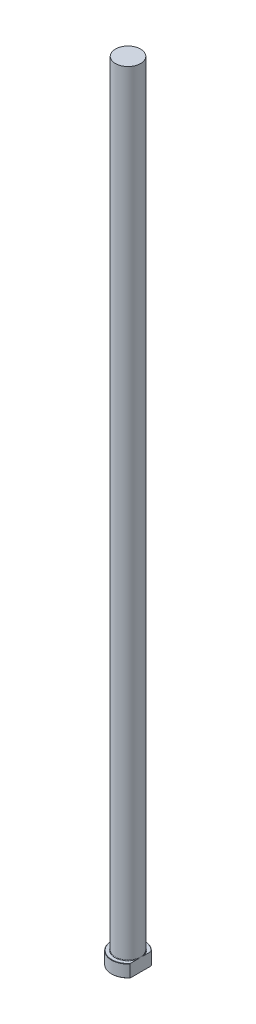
ISO-10303-21;
HEADER;
FILE_DESCRIPTION(('STEP AP214'),'2;1');
FILE_NAME('part.step','',(''),(''),'','','');
FILE_SCHEMA(('AUTOMOTIVE_DESIGN { 1 0 10303 214 1 1 1 1 }'));
ENDSEC;
DATA;
#1=APPLICATION_CONTEXT('core data for automotive mechanical design processes');
#2=APPLICATION_PROTOCOL_DEFINITION('international standard','automotive_design',2000,#1);
#3=PRODUCT_CONTEXT('',#1,'mechanical');
#4=PRODUCT('Part','Part','',(#3));
#5=PRODUCT_RELATED_PRODUCT_CATEGORY('part','',(#4));
#6=PRODUCT_DEFINITION_FORMATION('','',#4);
#7=PRODUCT_DEFINITION_CONTEXT('part definition',#1,'design');
#8=PRODUCT_DEFINITION('design','',#6,#7);
#9=PRODUCT_DEFINITION_SHAPE('','',#8);
#10=(LENGTH_UNIT() NAMED_UNIT(*) SI_UNIT(.MILLI.,.METRE.));
#11=(NAMED_UNIT(*) PLANE_ANGLE_UNIT() SI_UNIT($,.RADIAN.));
#12=(NAMED_UNIT(*) SI_UNIT($,.STERADIAN.) SOLID_ANGLE_UNIT());
#13=UNCERTAINTY_MEASURE_WITH_UNIT(LENGTH_MEASURE(1.E-05),#10,'distance_accuracy_value','');
#14=(GEOMETRIC_REPRESENTATION_CONTEXT(3) GLOBAL_UNCERTAINTY_ASSIGNED_CONTEXT((#13)) GLOBAL_UNIT_ASSIGNED_CONTEXT((#10,
#11,#12)) REPRESENTATION_CONTEXT('',''));
#15=CARTESIAN_POINT('',(0.,0.,0.));
#16=DIRECTION('',(0.,0.,1.));
#17=DIRECTION('',(1.,0.,0.));
#18=AXIS2_PLACEMENT_3D('',#15,#16,#17);
#19=CARTESIAN_POINT('',(0.,0.,0.));
#20=DIRECTION('',(0.,-1.,0.));
#21=DIRECTION('',(0.,0.,-1.));
#22=AXIS2_PLACEMENT_3D('',#19,#20,#21);
#23=PLANE('',#22);
#24=CARTESIAN_POINT('',(0.,0.,0.));
#25=DIRECTION('',(0.,-1.,0.));
#26=DIRECTION('',(0.,0.,-1.));
#27=AXIS2_PLACEMENT_3D('',#24,#25,#26);
#28=CIRCLE('',#27,10.3);
#29=CARTESIAN_POINT('',(7.99999999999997,0.,6.48768063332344));
#30=VERTEX_POINT('',#29);
#31=CARTESIAN_POINT('',(7.99999999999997,0.,-6.48768063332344));
#32=VERTEX_POINT('',#31);
#33=EDGE_CURVE('E98',#30,#32,#28,.T.);
#34=ORIENTED_EDGE('',*,*,#33,.T.);
#35=DIRECTION('',(0.,0.,1.));
#36=VECTOR('',#35,1.);
#37=CARTESIAN_POINT('',(7.99999999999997,0.,6.80073525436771));
#38=LINE('',#37,#36);
#39=EDGE_CURVE('E83',#32,#30,#38,.T.);
#40=ORIENTED_EDGE('',*,*,#39,.T.);
#41=EDGE_LOOP('',(#34,#40));
#42=FACE_BOUND('',#41,.T.);
#43=ADVANCED_FACE('F32',(#42),#23,.T.);
#44=CARTESIAN_POINT('',(0.,259.958771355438,0.));
#45=DIRECTION('',(0.,1.,0.));
#46=DIRECTION('',(0.,0.,1.));
#47=AXIS2_PLACEMENT_3D('',#44,#45,#46);
#48=CYLINDRICAL_SURFACE('',#47,10.5);
#49=CARTESIAN_POINT('',(0.,7.79999999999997,0.));
#50=DIRECTION('',(0.,1.,0.));
#51=DIRECTION('',(0.,0.,1.));
#52=AXIS2_PLACEMENT_3D('',#49,#50,#51);
#53=CIRCLE('',#52,10.5);
#54=CARTESIAN_POINT('',(7.99999999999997,7.79999999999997,6.80073525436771));
#55=VERTEX_POINT('',#54);
#56=CARTESIAN_POINT('',(7.99999999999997,7.79999999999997,-6.80073525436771));
#57=VERTEX_POINT('',#56);
#58=EDGE_CURVE('E104',#55,#57,#53,.F.);
#59=ORIENTED_EDGE('',*,*,#58,.T.);
#60=DIRECTION('',(0.,-1.,0.));
#61=VECTOR('',#60,1.);
#62=CARTESIAN_POINT('',(7.99999999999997,500.,-6.80073525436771));
#63=LINE('',#62,#61);
#64=CARTESIAN_POINT('',(7.99999999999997,0.199999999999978,-6.80073525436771));
#65=VERTEX_POINT('',#64);
#66=EDGE_CURVE('E183',#57,#65,#63,.T.);
#67=ORIENTED_EDGE('',*,*,#66,.T.);
#68=CARTESIAN_POINT('',(0.,0.199999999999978,0.));
#69=DIRECTION('',(0.,-1.,0.));
#70=DIRECTION('',(0.,0.,-1.));
#71=AXIS2_PLACEMENT_3D('',#68,#69,#70);
#72=CIRCLE('',#71,10.5);
#73=CARTESIAN_POINT('',(7.99999999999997,0.199999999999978,6.80073525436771));
#74=VERTEX_POINT('',#73);
#75=EDGE_CURVE('E100',#65,#74,#72,.F.);
#76=ORIENTED_EDGE('',*,*,#75,.T.);
#77=DIRECTION('',(0.,-1.,0.));
#78=VECTOR('',#77,1.);
#79=CARTESIAN_POINT('',(7.99999999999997,500.,6.80073525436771));
#80=LINE('',#79,#78);
#81=EDGE_CURVE('E93',#55,#74,#80,.T.);
#82=ORIENTED_EDGE('',*,*,#81,.F.);
#83=EDGE_LOOP('',(#59,#67,#76,#82));
#84=FACE_BOUND('',#83,.T.);
#85=ADVANCED_FACE('F158',(#84),#48,.T.);
#86=CARTESIAN_POINT('',(-10.5,8.,0.));
#87=DIRECTION('',(0.,1.,0.));
#88=DIRECTION('',(0.,0.,1.));
#89=AXIS2_PLACEMENT_3D('',#86,#87,#88);
#90=PLANE('',#89);
#91=CARTESIAN_POINT('',(0.,8.,0.));
#92=DIRECTION('',(0.,1.,0.));
#93=DIRECTION('',(0.,0.,1.));
#94=AXIS2_PLACEMENT_3D('',#91,#92,#93);
#95=CIRCLE('',#94,10.2999999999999);
#96=CARTESIAN_POINT('',(7.99999999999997,8.,-6.48768063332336));
#97=VERTEX_POINT('',#96);
#98=CARTESIAN_POINT('',(7.99999999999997,8.,6.48768063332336));
#99=VERTEX_POINT('',#98);
#100=EDGE_CURVE('E178',#97,#99,#95,.T.);
#101=ORIENTED_EDGE('',*,*,#100,.T.);
#102=DIRECTION('',(0.,0.,-1.));
#103=VECTOR('',#102,1.);
#104=CARTESIAN_POINT('',(7.99999999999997,8.,0.));
#105=LINE('',#104,#103);
#106=CARTESIAN_POINT('',(7.99999999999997,7.99999999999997,2.21133443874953));
#107=VERTEX_POINT('',#106);
#108=EDGE_CURVE('E57',#99,#107,#105,.T.);
#109=ORIENTED_EDGE('',*,*,#108,.T.);
#110=CARTESIAN_POINT('',(0.,8.,0.));
#111=DIRECTION('',(0.,1.,0.));
#112=DIRECTION('',(0.,0.,1.));
#113=AXIS2_PLACEMENT_3D('',#110,#111,#112);
#114=CIRCLE('',#113,8.29999999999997);
#115=CARTESIAN_POINT('',(7.99999999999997,7.99999999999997,-2.21133443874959));
#116=VERTEX_POINT('',#115);
#117=EDGE_CURVE('E107',#107,#116,#114,.F.);
#118=ORIENTED_EDGE('',*,*,#117,.T.);
#119=EDGE_CURVE('E136',#116,#97,#105,.T.);
#120=ORIENTED_EDGE('',*,*,#119,.T.);
#121=EDGE_LOOP('',(#101,#109,#118,#120));
#122=FACE_BOUND('',#121,.T.);
#123=ADVANCED_FACE('F147',(#122),#90,.T.);
#124=CARTESIAN_POINT('',(0.,8.00000000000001,0.));
#125=DIRECTION('',(0.,-1.,0.));
#126=DIRECTION('',(0.,0.,-1.));
#127=AXIS2_PLACEMENT_3D('',#124,#125,#126);
#128=CONICAL_SURFACE('',#127,10.2999999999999,0.785398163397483);
#129=ORIENTED_EDGE('',*,*,#58,.F.);
#130=CARTESIAN_POINT('',(7.99999999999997,1.33290288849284,14.962699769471));
#131=CARTESIAN_POINT('',(7.99999999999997,1.526020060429,14.743707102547));
#132=CARTESIAN_POINT('',(7.99999999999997,1.71861310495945,14.5242518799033));
#133=CARTESIAN_POINT('',(7.99999999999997,2.10260185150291,14.084291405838));
#134=CARTESIAN_POINT('',(7.99999999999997,2.29399753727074,13.8637861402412));
#135=CARTESIAN_POINT('',(7.99999999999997,2.86631093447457,13.2003384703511));
#136=CARTESIAN_POINT('',(7.99999999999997,3.24519896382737,12.7556406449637));
#137=CARTESIAN_POINT('',(7.99999999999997,4.0021705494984,11.8528322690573));
#138=CARTESIAN_POINT('',(7.99999999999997,4.38013535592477,11.3946217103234));
#139=CARTESIAN_POINT('',(7.99999999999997,4.93959938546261,10.7013455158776));
#140=CARTESIAN_POINT('',(7.99999999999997,5.12482184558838,10.4692838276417));
#141=CARTESIAN_POINT('',(7.99999999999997,5.49233220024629,10.0028504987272));
#142=CARTESIAN_POINT('',(7.99999999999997,5.67462014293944,9.76847889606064));
#143=CARTESIAN_POINT('',(7.99999999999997,6.03122068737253,9.30294410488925));
#144=CARTESIAN_POINT('',(7.99999999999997,6.20561882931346,9.071846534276));
#145=CARTESIAN_POINT('',(7.99999999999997,6.5504696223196,8.6067314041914));
#146=CARTESIAN_POINT('',(7.99999999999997,6.72092239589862,8.37271393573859));
#147=CARTESIAN_POINT('',(7.99999999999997,7.05721475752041,7.90111240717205));
#148=CARTESIAN_POINT('',(7.99999999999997,7.22305076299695,7.66352578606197));
#149=CARTESIAN_POINT('',(7.99999999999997,7.54895071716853,7.18442085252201));
#150=CARTESIAN_POINT('',(7.99999999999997,7.70901478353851,6.9429026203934));
#151=CARTESIAN_POINT('',(7.99999999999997,8.02131569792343,6.4564670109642));
#152=CARTESIAN_POINT('',(7.99999999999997,8.17358627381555,6.21157137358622));
#153=CARTESIAN_POINT('',(7.99999999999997,8.46946507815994,5.71653825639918));
#154=CARTESIAN_POINT('',(7.99999999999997,8.61307235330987,5.46640020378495));
#155=CARTESIAN_POINT('',(7.99999999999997,8.88928106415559,4.96049315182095));
#156=CARTESIAN_POINT('',(7.99999999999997,9.02189622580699,4.7047316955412));
#157=CARTESIAN_POINT('',(7.99999999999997,9.27354681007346,4.18665771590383));
#158=CARTESIAN_POINT('',(7.99999999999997,9.39258682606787,3.92434744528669));
#159=CARTESIAN_POINT('',(7.99999999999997,9.60651271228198,3.40995211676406));
#160=CARTESIAN_POINT('',(7.99999999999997,9.70246745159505,3.15831564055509));
#161=CARTESIAN_POINT('',(7.99999999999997,9.87629299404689,2.64880033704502));
#162=CARTESIAN_POINT('',(7.99999999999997,9.95416436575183,2.39092170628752));
#163=CARTESIAN_POINT('',(7.99999999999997,10.0879563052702,1.87092888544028));
#164=CARTESIAN_POINT('',(7.99999999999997,10.1439929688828,1.60884503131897));
#165=CARTESIAN_POINT('',(7.99999999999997,10.2315501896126,1.08057866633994));
#166=CARTESIAN_POINT('',(7.99999999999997,10.2630742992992,0.814396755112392));
#167=CARTESIAN_POINT('',(7.99999999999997,10.2997165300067,0.277429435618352));
#168=CARTESIAN_POINT('',(7.99999999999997,10.3045597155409,0.0066248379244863));
#169=CARTESIAN_POINT('',(7.99999999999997,10.2867490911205,-0.53406557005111));
#170=CARTESIAN_POINT('',(7.99999999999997,10.2640944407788,-0.803951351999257));
#171=CARTESIAN_POINT('',(7.99999999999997,10.1927263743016,-1.34133090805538));
#172=CARTESIAN_POINT('',(7.99999999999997,10.1439052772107,-1.60881012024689));
#173=CARTESIAN_POINT('',(7.99999999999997,10.0231407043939,-2.1384525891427));
#174=CARTESIAN_POINT('',(7.99999999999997,9.95119208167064,-2.40061464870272));
#175=CARTESIAN_POINT('',(7.99999999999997,9.74748024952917,-3.04636811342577));
#176=CARTESIAN_POINT('',(7.99999999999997,9.60371170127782,-3.42615269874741));
#177=CARTESIAN_POINT('',(7.99999999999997,9.28388635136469,-4.17181961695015));
#178=CARTESIAN_POINT('',(7.99999999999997,9.1078037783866,-4.53769057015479));
#179=CARTESIAN_POINT('',(7.99999999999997,8.73074535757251,-5.25986235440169));
#180=CARTESIAN_POINT('',(7.99999999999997,8.5295854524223,-5.61606586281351));
#181=CARTESIAN_POINT('',(7.99999999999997,8.10999259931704,-6.31785404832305));
#182=CARTESIAN_POINT('',(7.99999999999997,7.89156598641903,-6.66344255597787));
#183=CARTESIAN_POINT('',(7.99999999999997,7.42856923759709,-7.36627135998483));
#184=CARTESIAN_POINT('',(7.99999999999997,7.18321693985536,-7.72299299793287));
#185=CARTESIAN_POINT('',(7.99999999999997,6.68175990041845,-8.42882665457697));
#186=CARTESIAN_POINT('',(7.99999999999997,6.42565362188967,-8.77793757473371));
#187=CARTESIAN_POINT('',(7.99999999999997,5.90506129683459,-9.47030065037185));
#188=CARTESIAN_POINT('',(7.99999999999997,5.64056823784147,-9.81354751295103));
#189=CARTESIAN_POINT('',(7.99999999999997,5.10523485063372,-10.4950589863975));
#190=CARTESIAN_POINT('',(7.99999999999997,4.83439431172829,-10.8333234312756));
#191=CARTESIAN_POINT('',(7.99999999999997,4.29890379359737,-11.4919935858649));
#192=CARTESIAN_POINT('',(7.99999999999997,4.03445487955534,-11.8125631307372));
#193=CARTESIAN_POINT('',(7.99999999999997,3.5018148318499,-12.4505862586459));
#194=CARTESIAN_POINT('',(7.99999999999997,3.23362361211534,-12.7680397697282));
#195=CARTESIAN_POINT('',(7.99999999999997,2.69477946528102,-13.3996284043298));
#196=CARTESIAN_POINT('',(7.99999999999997,2.42413333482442,-13.7137693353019));
#197=CARTESIAN_POINT('',(7.99999999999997,1.88030288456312,-14.3398122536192));
#198=CARTESIAN_POINT('',(7.99999999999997,1.60711872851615,-14.6517143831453));
#199=CARTESIAN_POINT('',(7.99999999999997,1.33290288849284,-14.962699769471));
#200=B_SPLINE_CURVE_WITH_KNOTS('',3,(#130,#131,#132,#133,#134,#135,#136,#137,#138,#139,#140,
#141,#142,#143,#144,#145,#146,#147,#148,#149,#150,#151,#152,#153,#154,#155,#156,#157,#158,#159,
#160,#161,#162,#163,#164,#165,#166,#167,#168,#169,#170,#171,#172,#173,#174,#175,#176,#177,#178,
#179,#180,#181,#182,#183,#184,#185,#186,#187,#188,#189,#190,#191,#192,#193,#194,#195,#196,#197,
#198,#199),.UNSPECIFIED.,.F.,.F.,(4,2,2,2,2,2,2,2,2,2,2,2,2,2,2,2,2,2,2,2,2,2,2,2,2,2,2,2,2,2,2,
2,2,2,4),(0.,0.875937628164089,1.75188711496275,3.50449265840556,5.28632072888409,
6.17705462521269,7.06777388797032,7.93629376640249,8.8047866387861,9.67393565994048,
10.5430669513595,11.4080477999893,12.2731236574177,13.1371024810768,14.0007880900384,
14.8081551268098,15.6154967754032,16.4184851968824,17.221357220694,18.032487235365,
18.8436420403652,19.6581608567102,20.4728610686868,21.688930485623,22.9059739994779,
24.1325435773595,25.3586652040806,26.6572591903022,27.9560393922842,29.2559357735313,
30.5558753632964,31.8025502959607,33.0492539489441,34.2931865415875,35.5370394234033),.UNSPECIFIED.);
#201=EDGE_CURVE('E135',#55,#99,#200,.T.);
#202=ORIENTED_EDGE('',*,*,#201,.T.);
#203=ORIENTED_EDGE('',*,*,#100,.F.);
#204=EDGE_CURVE('E127',#97,#57,#200,.T.);
#205=ORIENTED_EDGE('',*,*,#204,.T.);
#206=EDGE_LOOP('',(#129,#202,#203,#205));
#207=FACE_BOUND('',#206,.T.);
#208=ADVANCED_FACE('F143',(#207),#128,.T.);
#209=CARTESIAN_POINT('',(0.,0.199999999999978,0.));
#210=DIRECTION('',(0.,1.,0.));
#211=DIRECTION('',(0.,0.,1.));
#212=AXIS2_PLACEMENT_3D('',#209,#210,#211);
#213=CONICAL_SURFACE('',#212,10.5,0.785398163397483);
#214=ORIENTED_EDGE('',*,*,#75,.F.);
#215=CARTESIAN_POINT('',(7.99999999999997,6.66709711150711,-14.962699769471));
#216=CARTESIAN_POINT('',(7.99999999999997,6.47397993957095,-14.743707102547));
#217=CARTESIAN_POINT('',(7.99999999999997,6.2813868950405,-14.5242518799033));
#218=CARTESIAN_POINT('',(7.99999999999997,5.89739814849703,-14.084291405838));
#219=CARTESIAN_POINT('',(7.99999999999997,5.7060024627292,-13.8637861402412));
#220=CARTESIAN_POINT('',(7.99999999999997,5.13368906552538,-13.2003384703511));
#221=CARTESIAN_POINT('',(7.99999999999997,4.75480103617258,-12.7556406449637));
#222=CARTESIAN_POINT('',(7.99999999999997,3.99782945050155,-11.8528322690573));
#223=CARTESIAN_POINT('',(7.99999999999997,3.61986464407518,-11.3946217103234));
#224=CARTESIAN_POINT('',(7.99999999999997,3.06040061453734,-10.7013455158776));
#225=CARTESIAN_POINT('',(7.99999999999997,2.87517815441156,-10.4692838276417));
#226=CARTESIAN_POINT('',(7.99999999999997,2.50766779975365,-10.0028504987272));
#227=CARTESIAN_POINT('',(7.99999999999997,2.32537985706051,-9.76847889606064));
#228=CARTESIAN_POINT('',(7.99999999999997,1.96877931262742,-9.30294410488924));
#229=CARTESIAN_POINT('',(7.99999999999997,1.79438117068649,-9.071846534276));
#230=CARTESIAN_POINT('',(7.99999999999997,1.44953037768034,-8.60673140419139));
#231=CARTESIAN_POINT('',(7.99999999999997,1.27907760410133,-8.37271393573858));
#232=CARTESIAN_POINT('',(7.99999999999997,0.942785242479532,-7.90111240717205));
#233=CARTESIAN_POINT('',(7.99999999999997,0.776949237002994,-7.66352578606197));
#234=CARTESIAN_POINT('',(7.99999999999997,0.451049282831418,-7.18442085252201));
#235=CARTESIAN_POINT('',(7.99999999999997,0.290985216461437,-6.9429026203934));
#236=CARTESIAN_POINT('',(7.99999999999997,-0.0213156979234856,-6.45646701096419));
#237=CARTESIAN_POINT('',(7.99999999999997,-0.173586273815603,-6.21157137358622));
#238=CARTESIAN_POINT('',(7.99999999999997,-0.469465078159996,-5.71653825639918));
#239=CARTESIAN_POINT('',(7.99999999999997,-0.613072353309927,-5.46640020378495));
#240=CARTESIAN_POINT('',(7.99999999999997,-0.88928106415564,-4.96049315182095));
#241=CARTESIAN_POINT('',(7.99999999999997,-1.02189622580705,-4.7047316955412));
#242=CARTESIAN_POINT('',(7.99999999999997,-1.27354681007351,-4.18665771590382));
#243=CARTESIAN_POINT('',(7.99999999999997,-1.39258682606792,-3.92434744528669));
#244=CARTESIAN_POINT('',(7.99999999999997,-1.60651271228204,-3.40995211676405));
#245=CARTESIAN_POINT('',(7.99999999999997,-1.70246745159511,-3.15831564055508));
#246=CARTESIAN_POINT('',(7.99999999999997,-1.87629299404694,-2.64880033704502));
#247=CARTESIAN_POINT('',(7.99999999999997,-1.95416436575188,-2.39092170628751));
#248=CARTESIAN_POINT('',(7.99999999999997,-2.08795630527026,-1.87092888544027));
#249=CARTESIAN_POINT('',(7.99999999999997,-2.14399296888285,-1.60884503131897));
#250=CARTESIAN_POINT('',(7.99999999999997,-2.23155018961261,-1.08057866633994));
#251=CARTESIAN_POINT('',(7.99999999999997,-2.26307429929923,-0.814396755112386));
#252=CARTESIAN_POINT('',(7.99999999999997,-2.29971653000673,-0.277429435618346));
#253=CARTESIAN_POINT('',(7.99999999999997,-2.30455971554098,-0.00662483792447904));
#254=CARTESIAN_POINT('',(7.99999999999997,-2.2867490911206,0.534065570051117));
#255=CARTESIAN_POINT('',(7.99999999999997,-2.26409444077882,0.803951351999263));
#256=CARTESIAN_POINT('',(7.99999999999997,-2.19272637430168,1.34133090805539));
#257=CARTESIAN_POINT('',(7.99999999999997,-2.14390527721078,1.6088101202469));
#258=CARTESIAN_POINT('',(7.99999999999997,-2.02314070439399,2.13845258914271));
#259=CARTESIAN_POINT('',(7.99999999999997,-1.95119208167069,2.40061464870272));
#260=CARTESIAN_POINT('',(7.99999999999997,-1.74748024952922,3.04636811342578));
#261=CARTESIAN_POINT('',(7.99999999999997,-1.60371170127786,3.42615269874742));
#262=CARTESIAN_POINT('',(7.99999999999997,-1.28388635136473,4.17181961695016));
#263=CARTESIAN_POINT('',(7.99999999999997,-1.10780377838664,4.5376905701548));
#264=CARTESIAN_POINT('',(7.99999999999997,-0.730745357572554,5.2598623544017));
#265=CARTESIAN_POINT('',(7.99999999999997,-0.529585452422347,5.61606586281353));
#266=CARTESIAN_POINT('',(7.99999999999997,-0.10999259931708,6.31785404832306));
#267=CARTESIAN_POINT('',(7.99999999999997,0.108434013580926,6.66344255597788));
#268=CARTESIAN_POINT('',(7.99999999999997,0.571430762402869,7.36627135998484));
#269=CARTESIAN_POINT('',(7.99999999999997,0.816783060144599,7.72299299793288));
#270=CARTESIAN_POINT('',(7.99999999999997,1.3182400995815,8.42882665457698));
#271=CARTESIAN_POINT('',(7.99999999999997,1.57434637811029,8.77793757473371));
#272=CARTESIAN_POINT('',(7.99999999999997,2.09493870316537,9.47030065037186));
#273=CARTESIAN_POINT('',(7.99999999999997,2.35943176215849,9.81354751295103));
#274=CARTESIAN_POINT('',(7.99999999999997,2.89476514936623,10.4950589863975));
#275=CARTESIAN_POINT('',(7.99999999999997,3.16560568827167,10.8333234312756));
#276=CARTESIAN_POINT('',(7.99999999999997,3.70109620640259,11.4919935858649));
#277=CARTESIAN_POINT('',(7.99999999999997,3.96554512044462,11.8125631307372));
#278=CARTESIAN_POINT('',(7.99999999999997,4.49818516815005,12.4505862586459));
#279=CARTESIAN_POINT('',(7.99999999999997,4.76637638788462,12.7680397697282));
#280=CARTESIAN_POINT('',(7.99999999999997,5.30522053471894,13.3996284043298));
#281=CARTESIAN_POINT('',(7.99999999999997,5.57586666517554,13.7137693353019));
#282=CARTESIAN_POINT('',(7.99999999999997,6.11969711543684,14.3398122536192));
#283=CARTESIAN_POINT('',(7.99999999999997,6.3928812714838,14.6517143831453));
#284=CARTESIAN_POINT('',(7.99999999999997,6.66709711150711,14.962699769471));
#285=B_SPLINE_CURVE_WITH_KNOTS('',3,(#215,#216,#217,#218,#219,#220,#221,#222,#223,#224,#225,
#226,#227,#228,#229,#230,#231,#232,#233,#234,#235,#236,#237,#238,#239,#240,#241,#242,#243,#244,
#245,#246,#247,#248,#249,#250,#251,#252,#253,#254,#255,#256,#257,#258,#259,#260,#261,#262,#263,
#264,#265,#266,#267,#268,#269,#270,#271,#272,#273,#274,#275,#276,#277,#278,#279,#280,#281,#282,
#283,#284),.UNSPECIFIED.,.F.,.F.,(4,2,2,2,2,2,2,2,2,2,2,2,2,2,2,2,2,2,2,2,2,2,2,2,2,2,2,2,2,2,2,
2,2,2,4),(0.,0.875937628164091,1.75188711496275,3.50449265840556,5.28632072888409,
6.17705462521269,7.06777388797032,7.93629376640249,8.80478663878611,9.67393565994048,
10.5430669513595,11.4080477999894,12.2731236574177,13.1371024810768,14.0007880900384,
14.8081551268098,15.6154967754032,16.4184851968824,17.221357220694,18.032487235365,
18.8436420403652,19.6581608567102,20.4728610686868,21.688930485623,22.9059739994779,
24.1325435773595,25.3586652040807,26.6572591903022,27.9560393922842,29.2559357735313,
30.5558753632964,31.8025502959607,33.0492539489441,34.2931865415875,35.5370394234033),.UNSPECIFIED.);
#286=EDGE_CURVE('E86',#65,#32,#285,.T.);
#287=ORIENTED_EDGE('',*,*,#286,.T.);
#288=ORIENTED_EDGE('',*,*,#33,.F.);
#289=EDGE_CURVE('E89',#30,#74,#285,.T.);
#290=ORIENTED_EDGE('',*,*,#289,.T.);
#291=EDGE_LOOP('',(#214,#287,#288,#290));
#292=FACE_BOUND('',#291,.T.);
#293=ADVANCED_FACE('F97',(#292),#213,.T.);
#294=CARTESIAN_POINT('',(0.,8.29999999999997,0.));
#295=DIRECTION('',(0.,1.,0.));
#296=DIRECTION('',(0.,0.,1.));
#297=AXIS2_PLACEMENT_3D('',#294,#295,#296);
#298=TOROIDAL_SURFACE('',#297,8.29999999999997,0.3);
#299=CARTESIAN_POINT('',(7.99999999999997,8.29999999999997,0.));
#300=CARTESIAN_POINT('',(7.99999999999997,8.30000062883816,1.41343117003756E-10));
#301=CARTESIAN_POINT('',(7.99999999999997,8.3000012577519,-3.45355392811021E-07));
#302=CARTESIAN_POINT('',(7.99999999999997,8.30000241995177,-1.23398477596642E-06));
#303=CARTESIAN_POINT('',(7.99999999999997,8.30000291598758,-1.80142002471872E-06));
#304=CARTESIAN_POINT('',(7.99999999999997,8.30000399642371,-3.18390860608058E-06));
#305=CARTESIAN_POINT('',(7.99999999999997,8.30000456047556,-4.02115855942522E-06));
#306=CARTESIAN_POINT('',(7.99999999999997,8.30000552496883,-5.71072486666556E-06));
#307=CARTESIAN_POINT('',(7.99999999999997,8.30000593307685,-6.55926466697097E-06));
#308=CARTESIAN_POINT('',(7.99999999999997,8.30000755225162,-1.00096417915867E-05));
#309=CARTESIAN_POINT('',(7.99999999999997,8.30000869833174,-1.26477249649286E-05));
#310=CARTESIAN_POINT('',(7.99999999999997,8.30001047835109,-1.77422286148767E-05));
#311=CARTESIAN_POINT('',(7.99999999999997,8.30001115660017,-2.01836510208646E-05));
#312=CARTESIAN_POINT('',(7.99999999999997,8.30001417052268,-3.09435602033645E-05));
#313=CARTESIAN_POINT('',(7.99999999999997,8.300016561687,-3.92473426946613E-05));
#314=CARTESIAN_POINT('',(7.99999999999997,8.30001991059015,-5.46311746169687E-05));
#315=CARTESIAN_POINT('',(7.99999999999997,8.30002104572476,-6.16717044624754E-05));
#316=CARTESIAN_POINT('',(7.99999999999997,8.30002955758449,-0.000115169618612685));
#317=CARTESIAN_POINT('',(7.99999999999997,8.30003630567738,-0.00016166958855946));
#318=CARTESIAN_POINT('',(7.99999999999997,8.30006581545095,-0.000347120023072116));
#319=CARTESIAN_POINT('',(7.99999999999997,8.30009364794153,-0.000485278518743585));
#320=CARTESIAN_POINT('',(7.99999999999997,8.30020325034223,-0.00103711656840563));
#321=CARTESIAN_POINT('',(7.99999999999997,8.30028197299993,-0.00145117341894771));
#322=CARTESIAN_POINT('',(7.99999999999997,8.30059973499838,-0.00311182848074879));
#323=CARTESIAN_POINT('',(7.99999999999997,8.3008427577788,-0.00435790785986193));
#324=CARTESIAN_POINT('',(7.99999999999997,8.30186073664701,-0.00958966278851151));
#325=CARTESIAN_POINT('',(7.99999999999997,8.30263061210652,-0.0135760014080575));
#326=CARTESIAN_POINT('',(7.99999999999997,8.30870312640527,-0.0450030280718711));
#327=CARTESIAN_POINT('',(7.99999999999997,8.31402334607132,-0.0724414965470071));
#328=CARTESIAN_POINT('',(7.99999999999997,8.32442239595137,-0.126197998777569));
#329=CARTESIAN_POINT('',(7.99999999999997,8.32950218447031,-0.152515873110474));
#330=CARTESIAN_POINT('',(7.99999999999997,8.34609783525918,-0.238680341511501));
#331=CARTESIAN_POINT('',(7.99999999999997,8.3575701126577,-0.298535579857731));
#332=CARTESIAN_POINT('',(7.99999999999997,8.37688511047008,-0.400403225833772));
#333=CARTESIAN_POINT('',(7.99999999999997,8.38478827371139,-0.442404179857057));
#334=CARTESIAN_POINT('',(7.99999999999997,8.40022249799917,-0.525284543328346));
#335=CARTESIAN_POINT('',(7.99999999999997,8.40775782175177,-0.566163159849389));
#336=CARTESIAN_POINT('',(7.99999999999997,8.4322438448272,-0.700743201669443));
#337=CARTESIAN_POINT('',(7.99999999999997,8.4487929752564,-0.794518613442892));
#338=CARTESIAN_POINT('',(7.99999999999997,8.48053424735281,-0.983225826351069));
#339=CARTESIAN_POINT('',(7.99999999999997,8.4957118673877,-1.07816009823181));
#340=CARTESIAN_POINT('',(7.99999999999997,8.52532008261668,-1.27781321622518));
#341=CARTESIAN_POINT('',(7.99999999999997,8.53952614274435,-1.38256589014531));
#342=CARTESIAN_POINT('',(7.99999999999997,8.56431037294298,-1.59223320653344));
#343=CARTESIAN_POINT('',(7.99999999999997,8.57489817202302,-1.69714666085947));
#344=CARTESIAN_POINT('',(7.99999999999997,8.58780012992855,-1.86417161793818));
#345=CARTESIAN_POINT('',(7.99999999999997,8.59172630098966,-1.92615747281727));
#346=CARTESIAN_POINT('',(7.99999999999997,8.59748111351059,-2.05022364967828));
#347=CARTESIAN_POINT('',(7.99999999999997,8.59931001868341,-2.11230395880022));
#348=CARTESIAN_POINT('',(7.99999999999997,8.60036180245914,-2.23528941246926));
#349=CARTESIAN_POINT('',(7.99999999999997,8.59963462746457,-2.29619395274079));
#350=CARTESIAN_POINT('',(7.99999999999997,8.59500883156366,-2.41785147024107));
#351=CARTESIAN_POINT('',(7.99999999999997,8.5911122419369,-2.47860451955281));
#352=CARTESIAN_POINT('',(7.99999999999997,8.57906933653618,-2.60042626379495));
#353=CARTESIAN_POINT('',(7.99999999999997,8.57087601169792,-2.66149089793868));
#354=CARTESIAN_POINT('',(7.99999999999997,8.55390997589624,-2.75233590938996));
#355=CARTESIAN_POINT('',(7.99999999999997,8.54745990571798,-2.78254437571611));
#356=CARTESIAN_POINT('',(7.99999999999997,8.5325641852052,-2.84244543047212));
#357=CARTESIAN_POINT('',(7.99999999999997,8.52412026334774,-2.87213844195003));
#358=CARTESIAN_POINT('',(7.99999999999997,8.50454333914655,-2.93081083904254));
#359=CARTESIAN_POINT('',(7.99999999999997,8.49339958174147,-2.95978684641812));
#360=CARTESIAN_POINT('',(7.99999999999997,8.47379430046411,-3.00191342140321));
#361=CARTESIAN_POINT('',(7.99999999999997,8.46677809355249,-3.01573193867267));
#362=CARTESIAN_POINT('',(7.99999999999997,8.45153430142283,-3.04267574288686));
#363=CARTESIAN_POINT('',(7.99999999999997,8.44330842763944,-3.05580197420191));
#364=CARTESIAN_POINT('',(7.99999999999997,8.42520334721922,-3.0811225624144));
#365=CARTESIAN_POINT('',(7.99999999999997,8.41530529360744,-3.09330368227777));
#366=CARTESIAN_POINT('',(7.99999999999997,8.39348961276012,-3.11567039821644));
#367=CARTESIAN_POINT('',(7.99999999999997,8.38158911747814,-3.12587146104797));
#368=CARTESIAN_POINT('',(7.99999999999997,8.36268099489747,-3.13802739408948));
#369=CARTESIAN_POINT('',(7.99999999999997,8.35660667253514,-3.14142291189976));
#370=CARTESIAN_POINT('',(7.99999999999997,8.34401523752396,-3.1472779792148));
#371=CARTESIAN_POINT('',(7.99999999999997,8.33749832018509,-3.14973793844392));
#372=CARTESIAN_POINT('',(7.99999999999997,8.32406766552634,-3.15352036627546));
#373=CARTESIAN_POINT('',(7.99999999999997,8.31715078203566,-3.15483196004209));
#374=CARTESIAN_POINT('',(7.99999999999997,8.30319454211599,-3.15612126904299));
#375=CARTESIAN_POINT('',(7.99999999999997,8.2961552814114,-3.15609998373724));
#376=CARTESIAN_POINT('',(7.99999999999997,8.28287791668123,-3.15479583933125));
#377=CARTESIAN_POINT('',(7.99999999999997,8.27662738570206,-3.15363338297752));
#378=CARTESIAN_POINT('',(7.99999999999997,8.26438977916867,-3.15033645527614));
#379=CARTESIAN_POINT('',(7.99999999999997,8.25840290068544,-3.14820126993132));
#380=CARTESIAN_POINT('',(7.99999999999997,8.24428488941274,-3.1420275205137));
#381=CARTESIAN_POINT('',(7.99999999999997,8.23634031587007,-3.1375652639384));
#382=CARTESIAN_POINT('',(7.99999999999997,8.2212475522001,-3.12745441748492));
#383=CARTESIAN_POINT('',(7.99999999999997,8.21410153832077,-3.12180270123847));
#384=CARTESIAN_POINT('',(7.99999999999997,8.19559955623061,-3.10524942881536));
#385=CARTESIAN_POINT('',(7.99999999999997,8.1849838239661,-3.09352989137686));
#386=CARTESIAN_POINT('',(7.99999999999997,8.16550497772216,-3.06874531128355));
#387=CARTESIAN_POINT('',(7.99999999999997,8.15664572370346,-3.05567739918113));
#388=CARTESIAN_POINT('',(7.99999999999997,8.13735489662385,-3.0239161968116));
#389=CARTESIAN_POINT('',(7.99999999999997,8.12749252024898,-3.00488123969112));
#390=CARTESIAN_POINT('',(7.99999999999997,8.1095818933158,-2.96596235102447));
#391=CARTESIAN_POINT('',(7.99999999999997,8.10153733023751,-2.94607678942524));
#392=CARTESIAN_POINT('',(7.99999999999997,8.08679055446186,-2.90559744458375));
#393=CARTESIAN_POINT('',(7.99999999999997,8.08010240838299,-2.88499860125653));
#394=CARTESIAN_POINT('',(7.99999999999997,8.06789000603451,-2.84348873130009));
#395=CARTESIAN_POINT('',(7.99999999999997,8.06236453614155,-2.82257805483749));
#396=CARTESIAN_POINT('',(7.99999999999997,8.04913807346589,-2.76752236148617));
#397=CARTESIAN_POINT('',(7.99999999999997,8.0422059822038,-2.73319311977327));
#398=CARTESIAN_POINT('',(7.99999999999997,8.03026051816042,-2.66419726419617));
#399=CARTESIAN_POINT('',(7.99999999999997,8.02524820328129,-2.62953047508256));
#400=CARTESIAN_POINT('',(7.99999999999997,8.01249500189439,-2.52504816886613));
#401=CARTESIAN_POINT('',(7.99999999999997,8.00708017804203,-2.45494936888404));
#402=CARTESIAN_POINT('',(7.99999999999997,8.00073392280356,-2.31725135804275));
#403=CARTESIAN_POINT('',(7.99999999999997,7.99964073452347,-2.24965783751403));
#404=CARTESIAN_POINT('',(7.99999999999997,8.00055672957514,-2.11488194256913));
#405=CARTESIAN_POINT('',(7.99999999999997,8.00254831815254,-2.04769941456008));
#406=CARTESIAN_POINT('',(7.99999999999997,8.0091166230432,-1.91019632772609));
#407=CARTESIAN_POINT('',(7.99999999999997,8.01381425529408,-1.83988191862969));
#408=CARTESIAN_POINT('',(7.99999999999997,8.02534418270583,-1.6994713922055));
#409=CARTESIAN_POINT('',(7.99999999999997,8.03217531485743,-1.62937517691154));
#410=CARTESIAN_POINT('',(7.99999999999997,8.04774659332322,-1.48770318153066));
#411=CARTESIAN_POINT('',(7.99999999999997,8.05652844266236,-1.41613205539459));
#412=CARTESIAN_POINT('',(7.99999999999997,8.07557199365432,-1.27299175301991));
#413=CARTESIAN_POINT('',(7.99999999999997,8.08583764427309,-1.20142310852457));
#414=CARTESIAN_POINT('',(7.99999999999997,8.1116703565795,-1.0311766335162));
#415=CARTESIAN_POINT('',(7.99999999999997,8.12776522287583,-0.93257940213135));
#416=CARTESIAN_POINT('',(7.99999999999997,8.16130143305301,-0.736797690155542));
#417=CARTESIAN_POINT('',(7.99999999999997,8.1787249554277,-0.639610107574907));
#418=CARTESIAN_POINT('',(7.99999999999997,8.21241690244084,-0.456833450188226));
#419=CARTESIAN_POINT('',(7.99999999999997,8.22858010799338,-0.371224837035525));
#420=CARTESIAN_POINT('',(7.99999999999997,8.25353789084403,-0.240583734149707));
#421=CARTESIAN_POINT('',(7.99999999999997,8.26219901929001,-0.195525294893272));
#422=CARTESIAN_POINT('',(7.99999999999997,8.2794503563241,-0.106166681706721));
#423=CARTESIAN_POINT('',(7.99999999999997,8.28803936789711,-0.0618662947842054));
#424=CARTESIAN_POINT('',(7.99999999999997,8.29737150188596,-0.0135646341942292));
#425=CARTESIAN_POINT('',(7.99999999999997,8.2981436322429,-0.00956694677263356));
#426=CARTESIAN_POINT('',(7.99999999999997,8.2991621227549,-0.00433268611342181));
#427=CARTESIAN_POINT('',(7.99999999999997,8.29940341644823,-0.00309545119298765));
#428=CARTESIAN_POINT('',(7.99999999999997,8.29971907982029,-0.00144576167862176));
#429=CARTESIAN_POINT('',(7.99999999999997,8.29979739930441,-0.00103382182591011));
#430=CARTESIAN_POINT('',(7.99999999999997,8.29990652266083,-0.000484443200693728));
#431=CARTESIAN_POINT('',(7.99999999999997,8.29993429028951,-0.000346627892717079));
#432=CARTESIAN_POINT('',(7.99999999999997,8.29996373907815,-0.000161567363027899));
#433=CARTESIAN_POINT('',(7.99999999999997,8.29997047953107,-0.000115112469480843));
#434=CARTESIAN_POINT('',(7.99999999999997,8.29997897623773,-6.16610394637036E-05));
#435=CARTESIAN_POINT('',(7.99999999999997,8.29998010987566,-5.46227094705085E-05));
#436=CARTESIAN_POINT('',(7.99999999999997,8.29998345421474,-3.92436777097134E-05));
#437=CARTESIAN_POINT('',(7.99999999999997,8.2999858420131,-3.09423885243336E-05));
#438=CARTESIAN_POINT('',(7.99999999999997,8.29998885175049,-2.01851373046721E-05));
#439=CARTESIAN_POINT('',(7.99999999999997,8.2999895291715,-1.77438781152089E-05));
#440=CARTESIAN_POINT('',(7.99999999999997,8.29999130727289,-1.26495944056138E-05));
#441=CARTESIAN_POINT('',(7.99999999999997,8.29999245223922,-1.00115441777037E-05));
#442=CARTESIAN_POINT('',(7.99999999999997,8.29999406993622,-6.56108556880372E-06));
#443=CARTESIAN_POINT('',(7.99999999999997,8.29999447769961,-5.71247474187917E-06));
#444=CARTESIAN_POINT('',(7.99999999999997,8.2999954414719,-4.02270435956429E-06));
#445=CARTESIAN_POINT('',(7.99999999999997,8.29999600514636,-3.18531725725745E-06));
#446=CARTESIAN_POINT('',(7.99999999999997,8.29999708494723,-1.80252027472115E-06));
#447=CARTESIAN_POINT('',(7.99999999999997,8.299997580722,-1.23492765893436E-06));
#448=CARTESIAN_POINT('',(7.99999999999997,8.29999874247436,-3.45879422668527E-07));
#449=CARTESIAN_POINT('',(7.99999999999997,8.29999937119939,-1.41334667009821E-10));
#450=CARTESIAN_POINT('',(7.99999999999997,8.29999999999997,0.));
#451=B_SPLINE_CURVE_WITH_KNOTS('',3,(#299,#300,#301,#302,#303,#304,#305,#306,#307,#308,#309,
#310,#311,#312,#313,#314,#315,#316,#317,#318,#319,#320,#321,#322,#323,#324,#325,#326,#327,#328,
#329,#330,#331,#332,#333,#334,#335,#336,#337,#338,#339,#340,#341,#342,#343,#344,#345,#346,#347,
#348,#349,#350,#351,#352,#353,#354,#355,#356,#357,#358,#359,#360,#361,#362,#363,#364,#365,#366,
#367,#368,#369,#370,#371,#372,#373,#374,#375,#376,#377,#378,#379,#380,#381,#382,#383,#384,#385,
#386,#387,#388,#389,#390,#391,#392,#393,#394,#395,#396,#397,#398,#399,#400,#401,#402,#403,#404,
#405,#406,#407,#408,#409,#410,#411,#412,#413,#414,#415,#416,#417,#418,#419,#420,#421,#422,#423,
#424,#425,#426,#427,#428,#429,#430,#431,#432,#433,#434,#435,#436,#437,#438,#439,#440,#441,#442,
#443,#444,#445,#446,#447,#448,#449,#450),.UNSPECIFIED.,.T.,.F.,(4,2,2,2,2,2,2,2,2,2,2,2,2,2,2,2,
2,2,2,2,2,2,2,2,2,2,2,2,2,2,2,2,2,2,2,2,2,2,2,2,2,2,2,2,2,2,2,2,2,2,2,2,2,2,2,2,2,2,2,2,2,2,2,2,
2,2,2,2,2,2,2,2,2,2,2,4),(0.,1.94304581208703E-06,4.23378739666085E-06,7.23541509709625E-06,
1.00606553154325E-05,1.86645529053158E-05,2.62590371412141E-05,5.21541704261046E-05,
7.35273763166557E-05,0.00021453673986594,0.000637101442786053,0.00190178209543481,
0.00571013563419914,0.0178905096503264,0.101737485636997,0.182148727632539,0.364982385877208,
0.493196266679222,0.617898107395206,0.90356316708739,1.19196538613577,1.50905932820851,
1.82530271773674,2.01160528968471,2.19788443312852,2.38054404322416,2.56308667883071,
2.7476694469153,2.84028504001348,2.93282063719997,3.02573110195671,3.07218090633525,
3.11856561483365,3.16551304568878,3.21207753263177,3.23289308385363,3.253699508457,
3.27470089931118,3.29568654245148,3.31467256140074,3.33367253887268,3.36085270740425,
3.38810522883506,3.43527567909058,3.4825486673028,3.54671214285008,3.61100462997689,
3.67593313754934,3.74079353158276,3.84578033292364,3.9508249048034,4.16152093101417,
4.3642515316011,4.5658300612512,4.77720385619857,4.98846262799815,5.20476776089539,
5.42165954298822,5.72134671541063,6.01755113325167,6.27891230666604,6.41656286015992,
6.5519362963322,6.56415137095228,6.567932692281,6.56919090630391,6.56961242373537,
6.56975329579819,6.56977466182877,6.56980054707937,6.56980814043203,6.56981674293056,
6.56981956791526,6.56982256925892,6.56982485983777,6.56982680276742),.UNSPECIFIED.);
#452=CARTESIAN_POINT('',(7.99999999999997,8.29999999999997,0.));
#453=VERTEX_POINT('',#452);
#454=EDGE_CURVE('E11',#116,#453,#451,.T.);
#455=ORIENTED_EDGE('',*,*,#454,.F.);
#456=ORIENTED_EDGE('',*,*,#117,.F.);
#457=CARTESIAN_POINT('',(7.99999999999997,8.29999999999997,0.));
#458=CARTESIAN_POINT('',(7.99999999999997,8.29999937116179,-1.41343471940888E-10));
#459=CARTESIAN_POINT('',(7.99999999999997,8.29999874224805,3.45355392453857E-07));
#460=CARTESIAN_POINT('',(7.99999999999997,8.29999758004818,1.23398477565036E-06));
#461=CARTESIAN_POINT('',(7.99999999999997,8.29999708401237,1.8014200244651E-06));
#462=CARTESIAN_POINT('',(7.99999999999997,8.29999600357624,3.18390860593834E-06));
#463=CARTESIAN_POINT('',(7.99999999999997,8.29999543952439,4.02115855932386E-06));
#464=CARTESIAN_POINT('',(7.99999999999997,8.29999447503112,5.71072486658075E-06));
#465=CARTESIAN_POINT('',(7.99999999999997,8.2999940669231,6.55926466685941E-06));
#466=CARTESIAN_POINT('',(7.99999999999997,8.29999244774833,1.00096417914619E-05));
#467=CARTESIAN_POINT('',(7.99999999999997,8.29999130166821,1.26477249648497E-05));
#468=CARTESIAN_POINT('',(7.99999999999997,8.29998952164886,1.77422286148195E-05));
#469=CARTESIAN_POINT('',(7.99999999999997,8.29998884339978,2.01836510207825E-05));
#470=CARTESIAN_POINT('',(7.99999999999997,8.29998582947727,3.09435602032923E-05));
#471=CARTESIAN_POINT('',(7.99999999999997,8.29998343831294,3.92473426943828E-05));
#472=CARTESIAN_POINT('',(7.99999999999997,8.29998008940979,5.46311746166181E-05));
#473=CARTESIAN_POINT('',(7.99999999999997,8.29997895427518,6.16717044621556E-05));
#474=CARTESIAN_POINT('',(7.99999999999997,8.29997044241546,0.000115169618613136));
#475=CARTESIAN_POINT('',(7.99999999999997,8.29996369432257,0.000161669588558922));
#476=CARTESIAN_POINT('',(7.99999999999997,8.29993418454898,0.000347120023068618));
#477=CARTESIAN_POINT('',(7.99999999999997,8.29990635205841,0.000485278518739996));
#478=CARTESIAN_POINT('',(7.99999999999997,8.29979674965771,0.00103711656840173));
#479=CARTESIAN_POINT('',(7.99999999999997,8.29971802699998,0.00145117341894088));
#480=CARTESIAN_POINT('',(7.99999999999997,8.2994002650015,0.00311182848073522));
#481=CARTESIAN_POINT('',(7.99999999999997,8.29915724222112,0.00435790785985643));
#482=CARTESIAN_POINT('',(7.99999999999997,8.29813926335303,0.0095896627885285));
#483=CARTESIAN_POINT('',(7.99999999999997,8.29736938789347,0.0135760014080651));
#484=CARTESIAN_POINT('',(7.99999999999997,8.2912968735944,0.04500302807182));
#485=CARTESIAN_POINT('',(7.99999999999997,8.28597665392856,0.0724414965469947));
#486=CARTESIAN_POINT('',(7.99999999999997,8.27557760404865,0.126197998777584));
#487=CARTESIAN_POINT('',(7.99999999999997,8.27049781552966,0.15251587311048));
#488=CARTESIAN_POINT('',(7.99999999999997,8.25390216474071,0.23868034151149));
#489=CARTESIAN_POINT('',(7.99999999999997,8.24242988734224,0.298535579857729));
#490=CARTESIAN_POINT('',(7.99999999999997,8.22311488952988,0.400403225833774));
#491=CARTESIAN_POINT('',(7.99999999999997,8.21521172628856,0.442404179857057));
#492=CARTESIAN_POINT('',(7.99999999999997,8.19977750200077,0.525284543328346));
#493=CARTESIAN_POINT('',(7.99999999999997,8.19224217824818,0.566163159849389));
#494=CARTESIAN_POINT('',(7.99999999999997,8.16775615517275,0.700743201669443));
#495=CARTESIAN_POINT('',(7.99999999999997,8.15120702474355,0.794518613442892));
#496=CARTESIAN_POINT('',(7.99999999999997,8.11946575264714,0.983225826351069));
#497=CARTESIAN_POINT('',(7.99999999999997,8.10428813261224,1.07816009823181));
#498=CARTESIAN_POINT('',(7.99999999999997,8.07467991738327,1.27781321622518));
#499=CARTESIAN_POINT('',(7.99999999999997,8.06047385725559,1.38256589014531));
#500=CARTESIAN_POINT('',(7.99999999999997,8.03568962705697,1.59223320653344));
#501=CARTESIAN_POINT('',(7.99999999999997,8.02510182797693,1.69714666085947));
#502=CARTESIAN_POINT('',(7.99999999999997,8.0121998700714,1.86417161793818));
#503=CARTESIAN_POINT('',(7.99999999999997,8.00827369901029,1.92615747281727));
#504=CARTESIAN_POINT('',(7.99999999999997,8.00251888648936,2.05022364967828));
#505=CARTESIAN_POINT('',(7.99999999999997,8.00068998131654,2.11230395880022));
#506=CARTESIAN_POINT('',(7.99999999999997,7.99963819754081,2.23528941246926));
#507=CARTESIAN_POINT('',(7.99999999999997,8.00036537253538,2.29619395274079));
#508=CARTESIAN_POINT('',(7.99999999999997,8.00499116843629,2.41785147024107));
#509=CARTESIAN_POINT('',(7.99999999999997,8.00888775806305,2.47860451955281));
#510=CARTESIAN_POINT('',(7.99999999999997,8.02093066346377,2.60042626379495));
#511=CARTESIAN_POINT('',(7.99999999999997,8.02912398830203,2.66149089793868));
#512=CARTESIAN_POINT('',(7.99999999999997,8.0460900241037,2.75233590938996));
#513=CARTESIAN_POINT('',(7.99999999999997,8.05254009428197,2.78254437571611));
#514=CARTESIAN_POINT('',(7.99999999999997,8.06743581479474,2.84244543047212));
#515=CARTESIAN_POINT('',(7.99999999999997,8.07587973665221,2.87213844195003));
#516=CARTESIAN_POINT('',(7.99999999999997,8.0954566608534,2.93081083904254));
#517=CARTESIAN_POINT('',(7.99999999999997,8.10660041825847,2.95978684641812));
#518=CARTESIAN_POINT('',(7.99999999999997,8.12620569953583,3.00191342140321));
#519=CARTESIAN_POINT('',(7.99999999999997,8.13322190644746,3.01573193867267));
#520=CARTESIAN_POINT('',(7.99999999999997,8.14846569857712,3.04267574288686));
#521=CARTESIAN_POINT('',(7.99999999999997,8.15669157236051,3.05580197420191));
#522=CARTESIAN_POINT('',(7.99999999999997,8.17479665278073,3.0811225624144));
#523=CARTESIAN_POINT('',(7.99999999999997,8.18469470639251,3.09330368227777));
#524=CARTESIAN_POINT('',(7.99999999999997,8.20651038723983,3.11567039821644));
#525=CARTESIAN_POINT('',(7.99999999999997,8.21841088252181,3.12587146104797));
#526=CARTESIAN_POINT('',(7.99999999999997,8.23731900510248,3.13802739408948));
#527=CARTESIAN_POINT('',(7.99999999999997,8.24339332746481,3.14142291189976));
#528=CARTESIAN_POINT('',(7.99999999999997,8.25598476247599,3.1472779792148));
#529=CARTESIAN_POINT('',(7.99999999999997,8.26250167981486,3.14973793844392));
#530=CARTESIAN_POINT('',(7.99999999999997,8.27593233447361,3.15352036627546));
#531=CARTESIAN_POINT('',(7.99999999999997,8.28284921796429,3.15483196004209));
#532=CARTESIAN_POINT('',(7.99999999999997,8.29680545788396,3.15612126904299));
#533=CARTESIAN_POINT('',(7.99999999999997,8.30384471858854,3.15609998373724));
#534=CARTESIAN_POINT('',(7.99999999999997,8.31712208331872,3.15479583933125));
#535=CARTESIAN_POINT('',(7.99999999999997,8.32337261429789,3.15363338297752));
#536=CARTESIAN_POINT('',(7.99999999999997,8.33561022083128,3.15033645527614));
#537=CARTESIAN_POINT('',(7.99999999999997,8.3415970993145,3.14820126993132));
#538=CARTESIAN_POINT('',(7.99999999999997,8.35571511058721,3.1420275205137));
#539=CARTESIAN_POINT('',(7.99999999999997,8.36365968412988,3.1375652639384));
#540=CARTESIAN_POINT('',(7.99999999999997,8.37875244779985,3.12745441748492));
#541=CARTESIAN_POINT('',(7.99999999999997,8.38589846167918,3.12180270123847));
#542=CARTESIAN_POINT('',(7.99999999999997,8.40440044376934,3.10524942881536));
#543=CARTESIAN_POINT('',(7.99999999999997,8.41501617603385,3.09352989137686));
#544=CARTESIAN_POINT('',(7.99999999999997,8.43449502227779,3.06874531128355));
#545=CARTESIAN_POINT('',(7.99999999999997,8.44335427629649,3.05567739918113));
#546=CARTESIAN_POINT('',(7.99999999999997,8.4626451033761,3.0239161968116));
#547=CARTESIAN_POINT('',(7.99999999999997,8.47250747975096,3.00488123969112));
#548=CARTESIAN_POINT('',(7.99999999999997,8.49041810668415,2.96596235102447));
#549=CARTESIAN_POINT('',(7.99999999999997,8.49846266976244,2.94607678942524));
#550=CARTESIAN_POINT('',(7.99999999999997,8.51320944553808,2.90559744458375));
#551=CARTESIAN_POINT('',(7.99999999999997,8.51989759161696,2.88499860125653));
#552=CARTESIAN_POINT('',(7.99999999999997,8.53210999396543,2.84348873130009));
#553=CARTESIAN_POINT('',(7.99999999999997,8.5376354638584,2.82257805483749));
#554=CARTESIAN_POINT('',(7.99999999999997,8.55086192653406,2.76752236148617));
#555=CARTESIAN_POINT('',(7.99999999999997,8.55779401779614,2.73319311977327));
#556=CARTESIAN_POINT('',(7.99999999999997,8.56973948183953,2.66419726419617));
#557=CARTESIAN_POINT('',(7.99999999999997,8.57475179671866,2.62953047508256));
#558=CARTESIAN_POINT('',(7.99999999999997,8.58750499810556,2.52504816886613));
#559=CARTESIAN_POINT('',(7.99999999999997,8.59291982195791,2.45494936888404));
#560=CARTESIAN_POINT('',(7.99999999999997,8.59926607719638,2.31725135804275));
#561=CARTESIAN_POINT('',(7.99999999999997,8.60035926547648,2.24965783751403));
#562=CARTESIAN_POINT('',(7.99999999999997,8.59944327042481,2.11488194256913));
#563=CARTESIAN_POINT('',(7.99999999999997,8.59745168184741,2.04769941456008));
#564=CARTESIAN_POINT('',(7.99999999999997,8.59088337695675,1.91019632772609));
#565=CARTESIAN_POINT('',(7.99999999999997,8.58618574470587,1.83988191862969));
#566=CARTESIAN_POINT('',(7.99999999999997,8.57465581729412,1.6994713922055));
#567=CARTESIAN_POINT('',(7.99999999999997,8.56782468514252,1.62937517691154));
#568=CARTESIAN_POINT('',(7.99999999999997,8.55225340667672,1.48770318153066));
#569=CARTESIAN_POINT('',(7.99999999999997,8.54347155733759,1.41613205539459));
#570=CARTESIAN_POINT('',(7.99999999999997,8.52442800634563,1.27299175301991));
#571=CARTESIAN_POINT('',(7.99999999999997,8.51416235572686,1.20142310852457));
#572=CARTESIAN_POINT('',(7.99999999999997,8.48832964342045,1.0311766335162));
#573=CARTESIAN_POINT('',(7.99999999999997,8.47223477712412,0.932579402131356));
#574=CARTESIAN_POINT('',(7.99999999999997,8.43869856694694,0.736797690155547));
#575=CARTESIAN_POINT('',(7.99999999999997,8.42127504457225,0.639610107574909));
#576=CARTESIAN_POINT('',(7.99999999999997,8.3875830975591,0.456833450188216));
#577=CARTESIAN_POINT('',(7.99999999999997,8.37141989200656,0.371224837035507));
#578=CARTESIAN_POINT('',(7.99999999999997,8.34646210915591,0.240583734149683));
#579=CARTESIAN_POINT('',(7.99999999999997,8.33780098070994,0.195525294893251));
#580=CARTESIAN_POINT('',(7.99999999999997,8.32054964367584,0.106166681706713));
#581=CARTESIAN_POINT('',(7.99999999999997,8.31196063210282,0.0618662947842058));
#582=CARTESIAN_POINT('',(7.99999999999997,8.30262849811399,0.0135646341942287));
#583=CARTESIAN_POINT('',(7.99999999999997,8.30185636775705,0.00956694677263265));
#584=CARTESIAN_POINT('',(7.99999999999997,8.30083787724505,0.00433268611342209));
#585=CARTESIAN_POINT('',(7.99999999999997,8.30059658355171,0.00309545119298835));
#586=CARTESIAN_POINT('',(7.99999999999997,8.30028092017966,0.00144576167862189));
#587=CARTESIAN_POINT('',(7.99999999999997,8.30020260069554,0.00103382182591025));
#588=CARTESIAN_POINT('',(7.99999999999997,8.30009347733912,0.000484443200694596));
#589=CARTESIAN_POINT('',(7.99999999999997,8.30006570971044,0.000346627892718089));
#590=CARTESIAN_POINT('',(7.99999999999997,8.3000362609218,0.000161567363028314));
#591=CARTESIAN_POINT('',(7.99999999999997,8.30002952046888,0.000115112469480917));
#592=CARTESIAN_POINT('',(7.99999999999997,8.30002102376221,6.16610394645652E-05));
#593=CARTESIAN_POINT('',(7.99999999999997,8.30001989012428,5.46227094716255E-05));
#594=CARTESIAN_POINT('',(7.99999999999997,8.3000165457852,3.92436777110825E-05));
#595=CARTESIAN_POINT('',(7.99999999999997,8.30001415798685,3.09423885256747E-05));
#596=CARTESIAN_POINT('',(7.99999999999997,8.30001114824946,2.01851373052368E-05));
#597=CARTESIAN_POINT('',(7.99999999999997,8.30001047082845,1.77438781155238E-05));
#598=CARTESIAN_POINT('',(7.99999999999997,8.30000869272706,1.26495944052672E-05));
#599=CARTESIAN_POINT('',(7.99999999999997,8.30000754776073,1.00115441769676E-05));
#600=CARTESIAN_POINT('',(7.99999999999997,8.30000593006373,6.56108556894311E-06));
#601=CARTESIAN_POINT('',(7.99999999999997,8.30000552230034,5.71247474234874E-06));
#602=CARTESIAN_POINT('',(7.99999999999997,8.30000455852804,4.02270436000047E-06));
#603=CARTESIAN_POINT('',(7.99999999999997,8.30000399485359,3.1853172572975E-06));
#604=CARTESIAN_POINT('',(7.99999999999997,8.30000291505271,1.80252027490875E-06));
#605=CARTESIAN_POINT('',(7.99999999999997,8.30000241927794,1.23492765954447E-06));
#606=CARTESIAN_POINT('',(7.99999999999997,8.30000125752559,3.45879423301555E-07));
#607=CARTESIAN_POINT('',(7.99999999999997,8.30000062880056,1.4133502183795E-10));
#608=CARTESIAN_POINT('',(7.99999999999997,8.29999999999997,0.));
#609=B_SPLINE_CURVE_WITH_KNOTS('',3,(#457,#458,#459,#460,#461,#462,#463,#464,#465,#466,#467,
#468,#469,#470,#471,#472,#473,#474,#475,#476,#477,#478,#479,#480,#481,#482,#483,#484,#485,#486,
#487,#488,#489,#490,#491,#492,#493,#494,#495,#496,#497,#498,#499,#500,#501,#502,#503,#504,#505,
#506,#507,#508,#509,#510,#511,#512,#513,#514,#515,#516,#517,#518,#519,#520,#521,#522,#523,#524,
#525,#526,#527,#528,#529,#530,#531,#532,#533,#534,#535,#536,#537,#538,#539,#540,#541,#542,#543,
#544,#545,#546,#547,#548,#549,#550,#551,#552,#553,#554,#555,#556,#557,#558,#559,#560,#561,#562,
#563,#564,#565,#566,#567,#568,#569,#570,#571,#572,#573,#574,#575,#576,#577,#578,#579,#580,#581,
#582,#583,#584,#585,#586,#587,#588,#589,#590,#591,#592,#593,#594,#595,#596,#597,#598,#599,#600,
#601,#602,#603,#604,#605,#606,#607,#608),.UNSPECIFIED.,.T.,.F.,(4,2,2,2,2,2,2,2,2,2,2,2,2,2,2,2,
2,2,2,2,2,2,2,2,2,2,2,2,2,2,2,2,2,2,2,2,2,2,2,2,2,2,2,2,2,2,2,2,2,2,2,2,2,2,2,2,2,2,2,2,2,2,2,2,
2,2,2,2,2,2,2,2,2,2,2,4),(0.,1.9430458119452E-06,4.23378739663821E-06,7.23541509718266E-06,
1.006065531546E-05,1.86645529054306E-05,2.62590371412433E-05,5.21541704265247E-05,
7.35273763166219E-05,0.000214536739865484,0.000637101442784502,0.00190178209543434,
0.00571013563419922,0.0178905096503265,0.101737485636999,0.182148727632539,0.364982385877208,
0.493196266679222,0.617898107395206,0.90356316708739,1.19196538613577,1.50905932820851,
1.82530271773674,2.01160528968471,2.19788443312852,2.38054404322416,2.56308667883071,
2.7476694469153,2.84028504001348,2.93282063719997,3.02573110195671,3.07218090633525,
3.11856561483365,3.16551304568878,3.21207753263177,3.23289308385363,3.253699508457,
3.27470089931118,3.29568654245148,3.31467256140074,3.33367253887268,3.36085270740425,
3.38810522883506,3.43527567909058,3.4825486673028,3.54671214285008,3.61100462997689,
3.67593313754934,3.74079353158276,3.84578033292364,3.9508249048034,4.16152093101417,
4.3642515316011,4.5658300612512,4.77720385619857,4.98846262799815,5.20476776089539,
5.42165954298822,5.72134671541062,6.01755113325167,6.27891230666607,6.41656286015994,
6.5519362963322,6.56415137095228,6.567932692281,6.5691909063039,6.56961242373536,
6.56975329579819,6.56977466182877,6.56980054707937,6.56980814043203,6.56981674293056,
6.56981956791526,6.56982256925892,6.56982485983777,6.56982680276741),.UNSPECIFIED.);
#610=EDGE_CURVE('E46',#453,#107,#609,.T.);
#611=ORIENTED_EDGE('',*,*,#610,.F.);
#612=CARTESIAN_POINT('',(0.,8.29999999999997,0.));
#613=DIRECTION('',(0.,1.,0.));
#614=DIRECTION('',(0.,0.,1.));
#615=AXIS2_PLACEMENT_3D('',#612,#613,#614);
#616=CIRCLE('',#615,7.99999999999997);
#617=EDGE_CURVE('E103',#453,#453,#616,.T.);
#618=ORIENTED_EDGE('',*,*,#617,.F.);
#619=EDGE_LOOP('',(#455,#456,#611,#618));
#620=FACE_BOUND('',#619,.T.);
#621=ADVANCED_FACE('F34',(#620),#298,.F.);
#622=CARTESIAN_POINT('',(0.,259.958771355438,0.));
#623=DIRECTION('',(0.,1.,0.));
#624=DIRECTION('',(0.,0.,1.));
#625=AXIS2_PLACEMENT_3D('',#622,#623,#624);
#626=CYLINDRICAL_SURFACE('',#625,7.99999999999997);
#627=ORIENTED_EDGE('',*,*,#617,.T.);
#628=EDGE_LOOP('',(#627));
#629=FACE_BOUND('',#628,.T.);
#630=CARTESIAN_POINT('',(0.,500.,0.));
#631=DIRECTION('',(0.,1.,0.));
#632=DIRECTION('',(0.,0.,1.));
#633=AXIS2_PLACEMENT_3D('',#630,#631,#632);
#634=CIRCLE('',#633,7.99999999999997);
#635=CARTESIAN_POINT('',(0.,500.,7.99999999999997));
#636=VERTEX_POINT('',#635);
#637=EDGE_CURVE('E101',#636,#636,#634,.T.);
#638=ORIENTED_EDGE('',*,*,#637,.F.);
#639=EDGE_LOOP('',(#638));
#640=FACE_BOUND('',#639,.T.);
#641=ADVANCED_FACE('F155',(#629,#640),#626,.T.);
#642=CARTESIAN_POINT('',(-7.99999999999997,500.,0.));
#643=DIRECTION('',(0.,1.,0.));
#644=DIRECTION('',(0.,0.,1.));
#645=AXIS2_PLACEMENT_3D('',#642,#643,#644);
#646=PLANE('',#645);
#647=ORIENTED_EDGE('',*,*,#637,.T.);
#648=EDGE_LOOP('',(#647));
#649=FACE_BOUND('',#648,.T.);
#650=ADVANCED_FACE('F121',(#649),#646,.T.);
#651=CARTESIAN_POINT('',(7.99999999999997,500.,6.80073525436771));
#652=DIRECTION('',(1.,0.,0.));
#653=DIRECTION('',(0.,0.,-1.));
#654=AXIS2_PLACEMENT_3D('',#651,#652,#653);
#655=PLANE('',#654);
#656=ORIENTED_EDGE('',*,*,#66,.F.);
#657=ORIENTED_EDGE('',*,*,#204,.F.);
#658=ORIENTED_EDGE('',*,*,#119,.F.);
#659=ORIENTED_EDGE('',*,*,#454,.T.);
#660=ORIENTED_EDGE('',*,*,#610,.T.);
#661=ORIENTED_EDGE('',*,*,#108,.F.);
#662=ORIENTED_EDGE('',*,*,#201,.F.);
#663=ORIENTED_EDGE('',*,*,#81,.T.);
#664=ORIENTED_EDGE('',*,*,#289,.F.);
#665=ORIENTED_EDGE('',*,*,#39,.F.);
#666=ORIENTED_EDGE('',*,*,#286,.F.);
#667=EDGE_LOOP('',(#656,#657,#658,#659,#660,#661,#662,#663,#664,#665,#666));
#668=FACE_BOUND('',#667,.T.);
#669=ADVANCED_FACE('F85',(#668),#655,.T.);
#670=CLOSED_SHELL('',(#43,#85,#123,#208,#293,#621,#641,#650,#669));
#671=MANIFOLD_SOLID_BREP('B2',#670);
#672=ADVANCED_BREP_SHAPE_REPRESENTATION('',(#18,#671),#14);
#673=SHAPE_DEFINITION_REPRESENTATION(#9,#672);
ENDSEC;
END-ISO-10303-21;
